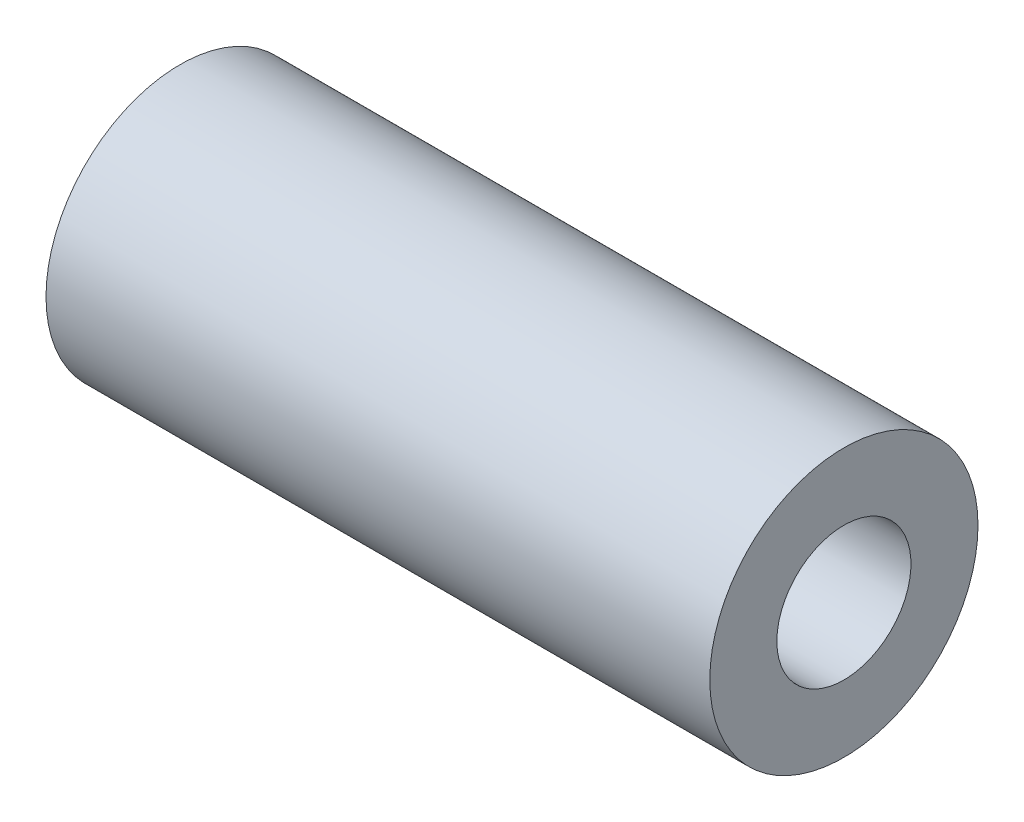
ISO-10303-21;
HEADER;
FILE_DESCRIPTION(('STEP AP214'),'2;1');
FILE_NAME('part.step','',(''),(''),'','','');
FILE_SCHEMA(('AUTOMOTIVE_DESIGN { 1 0 10303 214 1 1 1 1 }'));
ENDSEC;
DATA;
#1=APPLICATION_CONTEXT('core data for automotive mechanical design processes');
#2=APPLICATION_PROTOCOL_DEFINITION('international standard','automotive_design',2000,#1);
#3=PRODUCT_CONTEXT('',#1,'mechanical');
#4=PRODUCT('Part','Part','',(#3));
#5=PRODUCT_RELATED_PRODUCT_CATEGORY('part','',(#4));
#6=PRODUCT_DEFINITION_FORMATION('','',#4);
#7=PRODUCT_DEFINITION_CONTEXT('part definition',#1,'design');
#8=PRODUCT_DEFINITION('design','',#6,#7);
#9=PRODUCT_DEFINITION_SHAPE('','',#8);
#10=(LENGTH_UNIT() NAMED_UNIT(*) SI_UNIT(.MILLI.,.METRE.));
#11=(NAMED_UNIT(*) PLANE_ANGLE_UNIT() SI_UNIT($,.RADIAN.));
#12=(NAMED_UNIT(*) SI_UNIT($,.STERADIAN.) SOLID_ANGLE_UNIT());
#13=UNCERTAINTY_MEASURE_WITH_UNIT(LENGTH_MEASURE(1.E-05),#10,'distance_accuracy_value','');
#14=(GEOMETRIC_REPRESENTATION_CONTEXT(3) GLOBAL_UNCERTAINTY_ASSIGNED_CONTEXT((#13)) GLOBAL_UNIT_ASSIGNED_CONTEXT((#10,
#11,#12)) REPRESENTATION_CONTEXT('',''));
#15=CARTESIAN_POINT('',(0.,0.,0.));
#16=DIRECTION('',(0.,0.,1.));
#17=DIRECTION('',(1.,0.,0.));
#18=AXIS2_PLACEMENT_3D('',#15,#16,#17);
#19=CARTESIAN_POINT('',(-25.5720184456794,0.,0.));
#20=DIRECTION('',(-1.,0.,0.));
#21=DIRECTION('',(0.,0.,1.));
#22=AXIS2_PLACEMENT_3D('',#19,#20,#21);
#23=CYLINDRICAL_SURFACE('',#22,10.);
#24=CARTESIAN_POINT('',(-18.3801768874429,0.,0.));
#25=DIRECTION('',(-1.,0.,0.));
#26=DIRECTION('',(0.,0.,1.));
#27=AXIS2_PLACEMENT_3D('',#24,#25,#26);
#28=CIRCLE('',#27,10.);
#29=CARTESIAN_POINT('',(-18.3801768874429,0.,10.));
#30=VERTEX_POINT('',#29);
#31=EDGE_CURVE('E54',#30,#30,#28,.T.);
#32=ORIENTED_EDGE('',*,*,#31,.F.);
#33=EDGE_LOOP('',(#32));
#34=FACE_BOUND('',#33,.T.);
#35=CARTESIAN_POINT('',(31.1198231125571,0.,0.));
#36=DIRECTION('',(-1.,0.,0.));
#37=DIRECTION('',(0.,0.,1.));
#38=AXIS2_PLACEMENT_3D('',#35,#36,#37);
#39=CIRCLE('',#38,10.);
#40=CARTESIAN_POINT('',(31.1198231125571,0.,10.));
#41=VERTEX_POINT('',#40);
#42=EDGE_CURVE('E10',#41,#41,#39,.T.);
#43=ORIENTED_EDGE('',*,*,#42,.T.);
#44=EDGE_LOOP('',(#43));
#45=FACE_BOUND('',#44,.T.);
#46=ADVANCED_FACE('F37',(#34,#45),#23,.T.);
#47=CARTESIAN_POINT('',(31.1198231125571,10.,0.));
#48=DIRECTION('',(-1.,0.,0.));
#49=DIRECTION('',(0.,0.,1.));
#50=AXIS2_PLACEMENT_3D('',#47,#48,#49);
#51=PLANE('',#50);
#52=ORIENTED_EDGE('',*,*,#42,.F.);
#53=EDGE_LOOP('',(#52));
#54=FACE_BOUND('',#53,.T.);
#55=CARTESIAN_POINT('',(31.1198231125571,0.,0.));
#56=DIRECTION('',(-1.,0.,0.));
#57=DIRECTION('',(0.,0.,1.));
#58=AXIS2_PLACEMENT_3D('',#55,#56,#57);
#59=CIRCLE('',#58,5.);
#60=CARTESIAN_POINT('',(31.1198231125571,0.,5.));
#61=VERTEX_POINT('',#60);
#62=EDGE_CURVE('E44',#61,#61,#59,.T.);
#63=ORIENTED_EDGE('',*,*,#62,.T.);
#64=EDGE_LOOP('',(#63));
#65=FACE_BOUND('',#64,.T.);
#66=ADVANCED_FACE('F64',(#54,#65),#51,.F.);
#67=CARTESIAN_POINT('',(-25.5720184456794,0.,0.));
#68=DIRECTION('',(-1.,0.,0.));
#69=DIRECTION('',(0.,0.,1.));
#70=AXIS2_PLACEMENT_3D('',#67,#68,#69);
#71=CYLINDRICAL_SURFACE('',#70,5.);
#72=ORIENTED_EDGE('',*,*,#62,.F.);
#73=EDGE_LOOP('',(#72));
#74=FACE_BOUND('',#73,.T.);
#75=CARTESIAN_POINT('',(-18.3801768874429,0.,0.));
#76=DIRECTION('',(-1.,0.,0.));
#77=DIRECTION('',(0.,0.,1.));
#78=AXIS2_PLACEMENT_3D('',#75,#76,#77);
#79=CIRCLE('',#78,5.);
#80=CARTESIAN_POINT('',(-18.3801768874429,0.,5.));
#81=VERTEX_POINT('',#80);
#82=EDGE_CURVE('E49',#81,#81,#79,.T.);
#83=ORIENTED_EDGE('',*,*,#82,.T.);
#84=EDGE_LOOP('',(#83));
#85=FACE_BOUND('',#84,.T.);
#86=ADVANCED_FACE('F68',(#74,#85),#71,.F.);
#87=CARTESIAN_POINT('',(-18.3801768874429,5.,0.));
#88=DIRECTION('',(1.,0.,0.));
#89=DIRECTION('',(0.,0.,-1.));
#90=AXIS2_PLACEMENT_3D('',#87,#88,#89);
#91=PLANE('',#90);
#92=ORIENTED_EDGE('',*,*,#82,.F.);
#93=EDGE_LOOP('',(#92));
#94=FACE_BOUND('',#93,.T.);
#95=ORIENTED_EDGE('',*,*,#31,.T.);
#96=EDGE_LOOP('',(#95));
#97=FACE_BOUND('',#96,.T.);
#98=ADVANCED_FACE('F61',(#94,#97),#91,.F.);
#99=CLOSED_SHELL('',(#46,#66,#86,#98));
#100=MANIFOLD_SOLID_BREP('B2',#99);
#101=ADVANCED_BREP_SHAPE_REPRESENTATION('',(#18,#100),#14);
#102=SHAPE_DEFINITION_REPRESENTATION(#9,#101);
ENDSEC;
END-ISO-10303-21;
